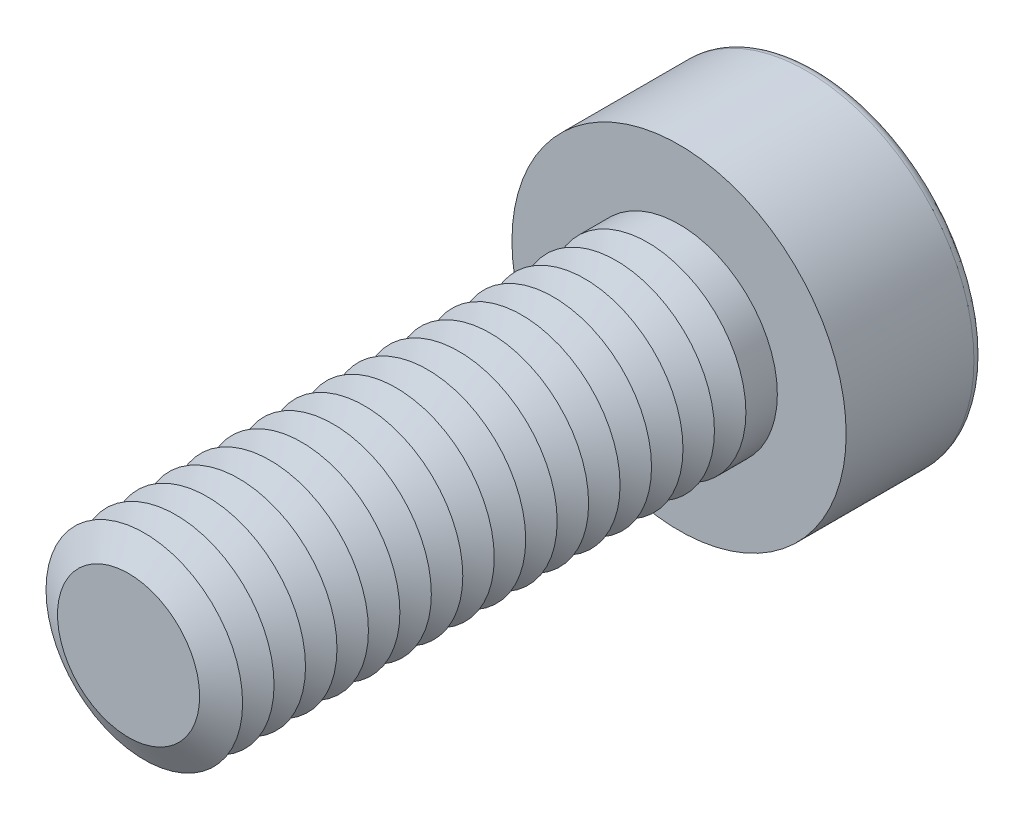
ISO-10303-21;
HEADER;
FILE_DESCRIPTION(('STEP AP214'),'2;1');
FILE_NAME('part.step','',(''),(''),'','','');
FILE_SCHEMA(('AUTOMOTIVE_DESIGN { 1 0 10303 214 1 1 1 1 }'));
ENDSEC;
DATA;
#1=APPLICATION_CONTEXT('core data for automotive mechanical design processes');
#2=APPLICATION_PROTOCOL_DEFINITION('international standard','automotive_design',2000,#1);
#3=PRODUCT_CONTEXT('',#1,'mechanical');
#4=PRODUCT('Part','Part','',(#3));
#5=PRODUCT_RELATED_PRODUCT_CATEGORY('part','',(#4));
#6=PRODUCT_DEFINITION_FORMATION('','',#4);
#7=PRODUCT_DEFINITION_CONTEXT('part definition',#1,'design');
#8=PRODUCT_DEFINITION('design','',#6,#7);
#9=PRODUCT_DEFINITION_SHAPE('','',#8);
#10=(LENGTH_UNIT() NAMED_UNIT(*) SI_UNIT(.MILLI.,.METRE.));
#11=(NAMED_UNIT(*) PLANE_ANGLE_UNIT() SI_UNIT($,.RADIAN.));
#12=(NAMED_UNIT(*) SI_UNIT($,.STERADIAN.) SOLID_ANGLE_UNIT());
#13=UNCERTAINTY_MEASURE_WITH_UNIT(LENGTH_MEASURE(1.E-05),#10,'distance_accuracy_value','');
#14=(GEOMETRIC_REPRESENTATION_CONTEXT(3) GLOBAL_UNCERTAINTY_ASSIGNED_CONTEXT((#13)) GLOBAL_UNIT_ASSIGNED_CONTEXT((#10,
#11,#12)) REPRESENTATION_CONTEXT('',''));
#15=CARTESIAN_POINT('',(0.,0.,0.));
#16=DIRECTION('',(0.,0.,1.));
#17=DIRECTION('',(1.,0.,0.));
#18=AXIS2_PLACEMENT_3D('',#15,#16,#17);
#19=CARTESIAN_POINT('',(0.,0.,11.2));
#20=DIRECTION('',(0.,0.,1.));
#21=DIRECTION('',(1.,0.,0.));
#22=AXIS2_PLACEMENT_3D('',#19,#20,#21);
#23=CONICAL_SURFACE('',#22,2.5,1.0471975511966);
#24=CARTESIAN_POINT('',(0.,0.,10.8));
#25=DIRECTION('',(0.,0.,1.));
#26=DIRECTION('',(1.,0.,0.));
#27=AXIS2_PLACEMENT_3D('',#24,#25,#26);
#28=CIRCLE('',#27,1.80717967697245);
#29=CARTESIAN_POINT('',(1.80717967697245,0.,10.8));
#30=VERTEX_POINT('',#29);
#31=EDGE_CURVE('E312',#30,#30,#28,.T.);
#32=ORIENTED_EDGE('',*,*,#31,.T.);
#33=EDGE_LOOP('',(#32));
#34=FACE_BOUND('',#33,.T.);
#35=CARTESIAN_POINT('',(0.,0.,11.2));
#36=DIRECTION('',(0.,0.,1.));
#37=DIRECTION('',(1.,0.,0.));
#38=AXIS2_PLACEMENT_3D('',#35,#36,#37);
#39=CIRCLE('',#38,2.5);
#40=CARTESIAN_POINT('',(2.5,0.,11.2));
#41=VERTEX_POINT('',#40);
#42=EDGE_CURVE('E315',#41,#41,#39,.T.);
#43=ORIENTED_EDGE('',*,*,#42,.F.);
#44=EDGE_LOOP('',(#43));
#45=FACE_BOUND('',#44,.T.);
#46=ADVANCED_FACE('F39',(#34,#45),#23,.T.);
#47=CARTESIAN_POINT('',(0.,0.,10.8));
#48=DIRECTION('',(0.,0.,-1.));
#49=DIRECTION('',(-1.,0.,0.));
#50=AXIS2_PLACEMENT_3D('',#47,#48,#49);
#51=CONICAL_SURFACE('',#50,1.80717967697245,1.0471975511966);
#52=CARTESIAN_POINT('',(0.,0.,10.4));
#53=DIRECTION('',(0.,0.,1.));
#54=DIRECTION('',(1.,0.,0.));
#55=AXIS2_PLACEMENT_3D('',#52,#53,#54);
#56=CIRCLE('',#55,2.5);
#57=CARTESIAN_POINT('',(2.5,0.,10.4));
#58=VERTEX_POINT('',#57);
#59=EDGE_CURVE('E323',#58,#58,#56,.T.);
#60=ORIENTED_EDGE('',*,*,#59,.T.);
#61=EDGE_LOOP('',(#60));
#62=FACE_BOUND('',#61,.T.);
#63=ORIENTED_EDGE('',*,*,#31,.F.);
#64=EDGE_LOOP('',(#63));
#65=FACE_BOUND('',#64,.T.);
#66=ADVANCED_FACE('F244',(#62,#65),#51,.T.);
#67=CARTESIAN_POINT('',(0.,0.,14.));
#68=DIRECTION('',(0.,0.,1.));
#69=DIRECTION('',(1.,0.,0.));
#70=AXIS2_PLACEMENT_3D('',#67,#68,#69);
#71=PLANE('',#70);
#72=CARTESIAN_POINT('',(0.,0.,14.));
#73=DIRECTION('',(0.,0.,1.));
#74=DIRECTION('',(1.,0.,0.));
#75=AXIS2_PLACEMENT_3D('',#72,#73,#74);
#76=CIRCLE('',#75,1.80717967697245);
#77=CARTESIAN_POINT('',(1.80717967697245,0.,14.));
#78=VERTEX_POINT('',#77);
#79=EDGE_CURVE('E173',#78,#78,#76,.T.);
#80=ORIENTED_EDGE('',*,*,#79,.T.);
#81=EDGE_LOOP('',(#80));
#82=FACE_BOUND('',#81,.T.);
#83=ADVANCED_FACE('F250',(#82),#71,.T.);
#84=CARTESIAN_POINT('',(0.,0.,14.));
#85=DIRECTION('',(0.,0.,-1.));
#86=DIRECTION('',(-1.,0.,0.));
#87=AXIS2_PLACEMENT_3D('',#84,#85,#86);
#88=CONICAL_SURFACE('',#87,1.80717967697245,1.0471975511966);
#89=CARTESIAN_POINT('',(0.,0.,13.6));
#90=DIRECTION('',(0.,0.,1.));
#91=DIRECTION('',(1.,0.,0.));
#92=AXIS2_PLACEMENT_3D('',#89,#90,#91);
#93=CIRCLE('',#92,2.5);
#94=CARTESIAN_POINT('',(2.5,0.,13.6));
#95=VERTEX_POINT('',#94);
#96=EDGE_CURVE('E290',#95,#95,#93,.T.);
#97=ORIENTED_EDGE('',*,*,#96,.T.);
#98=EDGE_LOOP('',(#97));
#99=FACE_BOUND('',#98,.T.);
#100=ORIENTED_EDGE('',*,*,#79,.F.);
#101=EDGE_LOOP('',(#100));
#102=FACE_BOUND('',#101,.T.);
#103=ADVANCED_FACE('F198',(#99,#102),#88,.T.);
#104=CARTESIAN_POINT('',(0.,0.,13.6));
#105=DIRECTION('',(0.,0.,1.));
#106=DIRECTION('',(1.,0.,0.));
#107=AXIS2_PLACEMENT_3D('',#104,#105,#106);
#108=CONICAL_SURFACE('',#107,2.5,1.0471975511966);
#109=CARTESIAN_POINT('',(0.,0.,13.2));
#110=DIRECTION('',(0.,0.,1.));
#111=DIRECTION('',(1.,0.,0.));
#112=AXIS2_PLACEMENT_3D('',#109,#110,#111);
#113=CIRCLE('',#112,1.80717967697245);
#114=CARTESIAN_POINT('',(1.80717967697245,0.,13.2));
#115=VERTEX_POINT('',#114);
#116=EDGE_CURVE('E287',#115,#115,#113,.T.);
#117=ORIENTED_EDGE('',*,*,#116,.T.);
#118=EDGE_LOOP('',(#117));
#119=FACE_BOUND('',#118,.T.);
#120=ORIENTED_EDGE('',*,*,#96,.F.);
#121=EDGE_LOOP('',(#120));
#122=FACE_BOUND('',#121,.T.);
#123=ADVANCED_FACE('F276',(#119,#122),#108,.T.);
#124=CARTESIAN_POINT('',(0.,0.,13.2));
#125=DIRECTION('',(0.,0.,-1.));
#126=DIRECTION('',(-1.,0.,0.));
#127=AXIS2_PLACEMENT_3D('',#124,#125,#126);
#128=CONICAL_SURFACE('',#127,1.80717967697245,1.0471975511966);
#129=CARTESIAN_POINT('',(0.,0.,12.8));
#130=DIRECTION('',(0.,0.,1.));
#131=DIRECTION('',(1.,0.,0.));
#132=AXIS2_PLACEMENT_3D('',#129,#130,#131);
#133=CIRCLE('',#132,2.5);
#134=CARTESIAN_POINT('',(2.5,0.,12.8));
#135=VERTEX_POINT('',#134);
#136=EDGE_CURVE('E298',#135,#135,#133,.T.);
#137=ORIENTED_EDGE('',*,*,#136,.T.);
#138=EDGE_LOOP('',(#137));
#139=FACE_BOUND('',#138,.T.);
#140=ORIENTED_EDGE('',*,*,#116,.F.);
#141=EDGE_LOOP('',(#140));
#142=FACE_BOUND('',#141,.T.);
#143=ADVANCED_FACE('F273',(#139,#142),#128,.T.);
#144=CARTESIAN_POINT('',(0.,0.,12.8));
#145=DIRECTION('',(0.,0.,1.));
#146=DIRECTION('',(1.,0.,0.));
#147=AXIS2_PLACEMENT_3D('',#144,#145,#146);
#148=CONICAL_SURFACE('',#147,2.5,1.0471975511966);
#149=CARTESIAN_POINT('',(0.,0.,12.4));
#150=DIRECTION('',(0.,0.,1.));
#151=DIRECTION('',(1.,0.,0.));
#152=AXIS2_PLACEMENT_3D('',#149,#150,#151);
#153=CIRCLE('',#152,1.80717967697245);
#154=CARTESIAN_POINT('',(1.80717967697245,0.,12.4));
#155=VERTEX_POINT('',#154);
#156=EDGE_CURVE('E292',#155,#155,#153,.T.);
#157=ORIENTED_EDGE('',*,*,#156,.T.);
#158=EDGE_LOOP('',(#157));
#159=FACE_BOUND('',#158,.T.);
#160=ORIENTED_EDGE('',*,*,#136,.F.);
#161=EDGE_LOOP('',(#160));
#162=FACE_BOUND('',#161,.T.);
#163=ADVANCED_FACE('F269',(#159,#162),#148,.T.);
#164=CARTESIAN_POINT('',(0.,0.,12.4));
#165=DIRECTION('',(0.,0.,-1.));
#166=DIRECTION('',(-1.,0.,0.));
#167=AXIS2_PLACEMENT_3D('',#164,#165,#166);
#168=CONICAL_SURFACE('',#167,1.80717967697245,1.0471975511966);
#169=CARTESIAN_POINT('',(0.,0.,12.));
#170=DIRECTION('',(0.,0.,1.));
#171=DIRECTION('',(1.,0.,0.));
#172=AXIS2_PLACEMENT_3D('',#169,#170,#171);
#173=CIRCLE('',#172,2.5);
#174=CARTESIAN_POINT('',(2.5,0.,12.));
#175=VERTEX_POINT('',#174);
#176=EDGE_CURVE('E308',#175,#175,#173,.T.);
#177=ORIENTED_EDGE('',*,*,#176,.T.);
#178=EDGE_LOOP('',(#177));
#179=FACE_BOUND('',#178,.T.);
#180=ORIENTED_EDGE('',*,*,#156,.F.);
#181=EDGE_LOOP('',(#180));
#182=FACE_BOUND('',#181,.T.);
#183=ADVANCED_FACE('F265',(#179,#182),#168,.T.);
#184=CARTESIAN_POINT('',(0.,0.,12.));
#185=DIRECTION('',(0.,0.,1.));
#186=DIRECTION('',(1.,0.,0.));
#187=AXIS2_PLACEMENT_3D('',#184,#185,#186);
#188=CONICAL_SURFACE('',#187,2.5,1.0471975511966);
#189=CARTESIAN_POINT('',(0.,0.,11.6));
#190=DIRECTION('',(0.,0.,1.));
#191=DIRECTION('',(1.,0.,0.));
#192=AXIS2_PLACEMENT_3D('',#189,#190,#191);
#193=CIRCLE('',#192,1.80717967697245);
#194=CARTESIAN_POINT('',(1.80717967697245,0.,11.6));
#195=VERTEX_POINT('',#194);
#196=EDGE_CURVE('E304',#195,#195,#193,.T.);
#197=ORIENTED_EDGE('',*,*,#196,.T.);
#198=EDGE_LOOP('',(#197));
#199=FACE_BOUND('',#198,.T.);
#200=ORIENTED_EDGE('',*,*,#176,.F.);
#201=EDGE_LOOP('',(#200));
#202=FACE_BOUND('',#201,.T.);
#203=ADVANCED_FACE('F261',(#199,#202),#188,.T.);
#204=CARTESIAN_POINT('',(0.,0.,11.6));
#205=DIRECTION('',(0.,0.,-1.));
#206=DIRECTION('',(-1.,0.,0.));
#207=AXIS2_PLACEMENT_3D('',#204,#205,#206);
#208=CONICAL_SURFACE('',#207,1.80717967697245,1.0471975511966);
#209=ORIENTED_EDGE('',*,*,#42,.T.);
#210=EDGE_LOOP('',(#209));
#211=FACE_BOUND('',#210,.T.);
#212=ORIENTED_EDGE('',*,*,#196,.F.);
#213=EDGE_LOOP('',(#212));
#214=FACE_BOUND('',#213,.T.);
#215=ADVANCED_FACE('F257',(#211,#214),#208,.T.);
#216=CARTESIAN_POINT('',(0.,0.,10.4));
#217=DIRECTION('',(0.,0.,1.));
#218=DIRECTION('',(1.,0.,0.));
#219=AXIS2_PLACEMENT_3D('',#216,#217,#218);
#220=CONICAL_SURFACE('',#219,2.5,1.0471975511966);
#221=CARTESIAN_POINT('',(0.,0.,10.));
#222=DIRECTION('',(0.,0.,1.));
#223=DIRECTION('',(1.,0.,0.));
#224=AXIS2_PLACEMENT_3D('',#221,#222,#223);
#225=CIRCLE('',#224,1.80717967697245);
#226=CARTESIAN_POINT('',(1.80717967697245,0.,10.));
#227=VERTEX_POINT('',#226);
#228=EDGE_CURVE('E319',#227,#227,#225,.T.);
#229=ORIENTED_EDGE('',*,*,#228,.T.);
#230=EDGE_LOOP('',(#229));
#231=FACE_BOUND('',#230,.T.);
#232=ORIENTED_EDGE('',*,*,#59,.F.);
#233=EDGE_LOOP('',(#232));
#234=FACE_BOUND('',#233,.T.);
#235=ADVANCED_FACE('F260',(#231,#234),#220,.T.);
#236=CARTESIAN_POINT('',(0.,0.,10.));
#237=DIRECTION('',(0.,0.,-1.));
#238=DIRECTION('',(-1.,0.,0.));
#239=AXIS2_PLACEMENT_3D('',#236,#237,#238);
#240=CONICAL_SURFACE('',#239,1.80717967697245,1.0471975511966);
#241=CARTESIAN_POINT('',(0.,0.,9.6));
#242=DIRECTION('',(0.,0.,1.));
#243=DIRECTION('',(1.,0.,0.));
#244=AXIS2_PLACEMENT_3D('',#241,#242,#243);
#245=CIRCLE('',#244,2.5);
#246=CARTESIAN_POINT('',(2.5,0.,9.6));
#247=VERTEX_POINT('',#246);
#248=EDGE_CURVE('E330',#247,#247,#245,.T.);
#249=ORIENTED_EDGE('',*,*,#248,.T.);
#250=EDGE_LOOP('',(#249));
#251=FACE_BOUND('',#250,.T.);
#252=ORIENTED_EDGE('',*,*,#228,.F.);
#253=EDGE_LOOP('',(#252));
#254=FACE_BOUND('',#253,.T.);
#255=ADVANCED_FACE('F509',(#251,#254),#240,.T.);
#256=CARTESIAN_POINT('',(0.,0.,9.6));
#257=DIRECTION('',(0.,0.,1.));
#258=DIRECTION('',(1.,0.,0.));
#259=AXIS2_PLACEMENT_3D('',#256,#257,#258);
#260=CONICAL_SURFACE('',#259,2.5,1.0471975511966);
#261=CARTESIAN_POINT('',(0.,0.,9.2));
#262=DIRECTION('',(0.,0.,1.));
#263=DIRECTION('',(1.,0.,0.));
#264=AXIS2_PLACEMENT_3D('',#261,#262,#263);
#265=CIRCLE('',#264,1.80717967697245);
#266=CARTESIAN_POINT('',(1.80717967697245,0.,9.2));
#267=VERTEX_POINT('',#266);
#268=EDGE_CURVE('E326',#267,#267,#265,.T.);
#269=ORIENTED_EDGE('',*,*,#268,.T.);
#270=EDGE_LOOP('',(#269));
#271=FACE_BOUND('',#270,.T.);
#272=ORIENTED_EDGE('',*,*,#248,.F.);
#273=EDGE_LOOP('',(#272));
#274=FACE_BOUND('',#273,.T.);
#275=ADVANCED_FACE('F505',(#271,#274),#260,.T.);
#276=CARTESIAN_POINT('',(0.,0.,9.2));
#277=DIRECTION('',(0.,0.,-1.));
#278=DIRECTION('',(-1.,0.,0.));
#279=AXIS2_PLACEMENT_3D('',#276,#277,#278);
#280=CONICAL_SURFACE('',#279,1.80717967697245,1.0471975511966);
#281=CARTESIAN_POINT('',(0.,0.,8.8));
#282=DIRECTION('',(0.,0.,1.));
#283=DIRECTION('',(1.,0.,0.));
#284=AXIS2_PLACEMENT_3D('',#281,#282,#283);
#285=CIRCLE('',#284,2.5);
#286=CARTESIAN_POINT('',(2.5,0.,8.8));
#287=VERTEX_POINT('',#286);
#288=EDGE_CURVE('E338',#287,#287,#285,.T.);
#289=ORIENTED_EDGE('',*,*,#288,.T.);
#290=EDGE_LOOP('',(#289));
#291=FACE_BOUND('',#290,.T.);
#292=ORIENTED_EDGE('',*,*,#268,.F.);
#293=EDGE_LOOP('',(#292));
#294=FACE_BOUND('',#293,.T.);
#295=ADVANCED_FACE('F501',(#291,#294),#280,.T.);
#296=CARTESIAN_POINT('',(0.,0.,8.8));
#297=DIRECTION('',(0.,0.,1.));
#298=DIRECTION('',(1.,0.,0.));
#299=AXIS2_PLACEMENT_3D('',#296,#297,#298);
#300=CONICAL_SURFACE('',#299,2.5,1.0471975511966);
#301=CARTESIAN_POINT('',(0.,0.,8.4));
#302=DIRECTION('',(0.,0.,1.));
#303=DIRECTION('',(1.,0.,0.));
#304=AXIS2_PLACEMENT_3D('',#301,#302,#303);
#305=CIRCLE('',#304,1.80717967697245);
#306=CARTESIAN_POINT('',(1.80717967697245,0.,8.4));
#307=VERTEX_POINT('',#306);
#308=EDGE_CURVE('E334',#307,#307,#305,.T.);
#309=ORIENTED_EDGE('',*,*,#308,.T.);
#310=EDGE_LOOP('',(#309));
#311=FACE_BOUND('',#310,.T.);
#312=ORIENTED_EDGE('',*,*,#288,.F.);
#313=EDGE_LOOP('',(#312));
#314=FACE_BOUND('',#313,.T.);
#315=ADVANCED_FACE('F497',(#311,#314),#300,.T.);
#316=CARTESIAN_POINT('',(0.,0.,8.4));
#317=DIRECTION('',(0.,0.,-1.));
#318=DIRECTION('',(-1.,0.,0.));
#319=AXIS2_PLACEMENT_3D('',#316,#317,#318);
#320=CONICAL_SURFACE('',#319,1.80717967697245,1.0471975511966);
#321=CARTESIAN_POINT('',(0.,0.,8.));
#322=DIRECTION('',(0.,0.,1.));
#323=DIRECTION('',(1.,0.,0.));
#324=AXIS2_PLACEMENT_3D('',#321,#322,#323);
#325=CIRCLE('',#324,2.5);
#326=CARTESIAN_POINT('',(2.5,0.,8.));
#327=VERTEX_POINT('',#326);
#328=EDGE_CURVE('E345',#327,#327,#325,.T.);
#329=ORIENTED_EDGE('',*,*,#328,.T.);
#330=EDGE_LOOP('',(#329));
#331=FACE_BOUND('',#330,.T.);
#332=ORIENTED_EDGE('',*,*,#308,.F.);
#333=EDGE_LOOP('',(#332));
#334=FACE_BOUND('',#333,.T.);
#335=ADVANCED_FACE('F493',(#331,#334),#320,.T.);
#336=CARTESIAN_POINT('',(0.,0.,8.));
#337=DIRECTION('',(0.,0.,1.));
#338=DIRECTION('',(1.,0.,0.));
#339=AXIS2_PLACEMENT_3D('',#336,#337,#338);
#340=CONICAL_SURFACE('',#339,2.5,1.0471975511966);
#341=CARTESIAN_POINT('',(0.,0.,7.6));
#342=DIRECTION('',(0.,0.,1.));
#343=DIRECTION('',(1.,0.,0.));
#344=AXIS2_PLACEMENT_3D('',#341,#342,#343);
#345=CIRCLE('',#344,1.80717967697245);
#346=CARTESIAN_POINT('',(1.80717967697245,0.,7.6));
#347=VERTEX_POINT('',#346);
#348=EDGE_CURVE('E341',#347,#347,#345,.T.);
#349=ORIENTED_EDGE('',*,*,#348,.T.);
#350=EDGE_LOOP('',(#349));
#351=FACE_BOUND('',#350,.T.);
#352=ORIENTED_EDGE('',*,*,#328,.F.);
#353=EDGE_LOOP('',(#352));
#354=FACE_BOUND('',#353,.T.);
#355=ADVANCED_FACE('F489',(#351,#354),#340,.T.);
#356=CARTESIAN_POINT('',(0.,0.,7.6));
#357=DIRECTION('',(0.,0.,-1.));
#358=DIRECTION('',(-1.,0.,0.));
#359=AXIS2_PLACEMENT_3D('',#356,#357,#358);
#360=CONICAL_SURFACE('',#359,1.80717967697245,1.0471975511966);
#361=CARTESIAN_POINT('',(0.,0.,7.2));
#362=DIRECTION('',(0.,0.,1.));
#363=DIRECTION('',(1.,0.,0.));
#364=AXIS2_PLACEMENT_3D('',#361,#362,#363);
#365=CIRCLE('',#364,2.5);
#366=CARTESIAN_POINT('',(2.5,0.,7.2));
#367=VERTEX_POINT('',#366);
#368=EDGE_CURVE('E353',#367,#367,#365,.T.);
#369=ORIENTED_EDGE('',*,*,#368,.T.);
#370=EDGE_LOOP('',(#369));
#371=FACE_BOUND('',#370,.T.);
#372=ORIENTED_EDGE('',*,*,#348,.F.);
#373=EDGE_LOOP('',(#372));
#374=FACE_BOUND('',#373,.T.);
#375=ADVANCED_FACE('F485',(#371,#374),#360,.T.);
#376=CARTESIAN_POINT('',(0.,0.,7.2));
#377=DIRECTION('',(0.,0.,1.));
#378=DIRECTION('',(1.,0.,0.));
#379=AXIS2_PLACEMENT_3D('',#376,#377,#378);
#380=CONICAL_SURFACE('',#379,2.5,1.0471975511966);
#381=CARTESIAN_POINT('',(0.,0.,6.8));
#382=DIRECTION('',(0.,0.,1.));
#383=DIRECTION('',(1.,0.,0.));
#384=AXIS2_PLACEMENT_3D('',#381,#382,#383);
#385=CIRCLE('',#384,1.80717967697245);
#386=CARTESIAN_POINT('',(1.80717967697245,0.,6.8));
#387=VERTEX_POINT('',#386);
#388=EDGE_CURVE('E349',#387,#387,#385,.T.);
#389=ORIENTED_EDGE('',*,*,#388,.T.);
#390=EDGE_LOOP('',(#389));
#391=FACE_BOUND('',#390,.T.);
#392=ORIENTED_EDGE('',*,*,#368,.F.);
#393=EDGE_LOOP('',(#392));
#394=FACE_BOUND('',#393,.T.);
#395=ADVANCED_FACE('F481',(#391,#394),#380,.T.);
#396=CARTESIAN_POINT('',(0.,0.,6.8));
#397=DIRECTION('',(0.,0.,-1.));
#398=DIRECTION('',(-1.,0.,0.));
#399=AXIS2_PLACEMENT_3D('',#396,#397,#398);
#400=CONICAL_SURFACE('',#399,1.80717967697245,1.0471975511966);
#401=CARTESIAN_POINT('',(0.,0.,6.4));
#402=DIRECTION('',(0.,0.,1.));
#403=DIRECTION('',(1.,0.,0.));
#404=AXIS2_PLACEMENT_3D('',#401,#402,#403);
#405=CIRCLE('',#404,2.5);
#406=CARTESIAN_POINT('',(2.5,0.,6.4));
#407=VERTEX_POINT('',#406);
#408=EDGE_CURVE('E361',#407,#407,#405,.T.);
#409=ORIENTED_EDGE('',*,*,#408,.T.);
#410=EDGE_LOOP('',(#409));
#411=FACE_BOUND('',#410,.T.);
#412=ORIENTED_EDGE('',*,*,#388,.F.);
#413=EDGE_LOOP('',(#412));
#414=FACE_BOUND('',#413,.T.);
#415=ADVANCED_FACE('F477',(#411,#414),#400,.T.);
#416=CARTESIAN_POINT('',(0.,0.,6.4));
#417=DIRECTION('',(0.,0.,1.));
#418=DIRECTION('',(1.,0.,0.));
#419=AXIS2_PLACEMENT_3D('',#416,#417,#418);
#420=CONICAL_SURFACE('',#419,2.5,1.0471975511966);
#421=CARTESIAN_POINT('',(0.,0.,6.));
#422=DIRECTION('',(0.,0.,1.));
#423=DIRECTION('',(1.,0.,0.));
#424=AXIS2_PLACEMENT_3D('',#421,#422,#423);
#425=CIRCLE('',#424,1.80717967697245);
#426=CARTESIAN_POINT('',(1.80717967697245,0.,6.));
#427=VERTEX_POINT('',#426);
#428=EDGE_CURVE('E357',#427,#427,#425,.T.);
#429=ORIENTED_EDGE('',*,*,#428,.T.);
#430=EDGE_LOOP('',(#429));
#431=FACE_BOUND('',#430,.T.);
#432=ORIENTED_EDGE('',*,*,#408,.F.);
#433=EDGE_LOOP('',(#432));
#434=FACE_BOUND('',#433,.T.);
#435=ADVANCED_FACE('F473',(#431,#434),#420,.T.);
#436=CARTESIAN_POINT('',(0.,0.,6.));
#437=DIRECTION('',(0.,0.,-1.));
#438=DIRECTION('',(-1.,0.,0.));
#439=AXIS2_PLACEMENT_3D('',#436,#437,#438);
#440=CONICAL_SURFACE('',#439,1.80717967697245,1.0471975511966);
#441=CARTESIAN_POINT('',(0.,0.,5.6));
#442=DIRECTION('',(0.,0.,1.));
#443=DIRECTION('',(1.,0.,0.));
#444=AXIS2_PLACEMENT_3D('',#441,#442,#443);
#445=CIRCLE('',#444,2.5);
#446=CARTESIAN_POINT('',(2.5,0.,5.6));
#447=VERTEX_POINT('',#446);
#448=EDGE_CURVE('E369',#447,#447,#445,.T.);
#449=ORIENTED_EDGE('',*,*,#448,.T.);
#450=EDGE_LOOP('',(#449));
#451=FACE_BOUND('',#450,.T.);
#452=ORIENTED_EDGE('',*,*,#428,.F.);
#453=EDGE_LOOP('',(#452));
#454=FACE_BOUND('',#453,.T.);
#455=ADVANCED_FACE('F469',(#451,#454),#440,.T.);
#456=CARTESIAN_POINT('',(0.,0.,5.6));
#457=DIRECTION('',(0.,0.,1.));
#458=DIRECTION('',(1.,0.,0.));
#459=AXIS2_PLACEMENT_3D('',#456,#457,#458);
#460=CONICAL_SURFACE('',#459,2.5,1.0471975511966);
#461=CARTESIAN_POINT('',(0.,0.,5.2));
#462=DIRECTION('',(0.,0.,1.));
#463=DIRECTION('',(1.,0.,0.));
#464=AXIS2_PLACEMENT_3D('',#461,#462,#463);
#465=CIRCLE('',#464,1.80717967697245);
#466=CARTESIAN_POINT('',(1.80717967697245,0.,5.2));
#467=VERTEX_POINT('',#466);
#468=EDGE_CURVE('E365',#467,#467,#465,.T.);
#469=ORIENTED_EDGE('',*,*,#468,.T.);
#470=EDGE_LOOP('',(#469));
#471=FACE_BOUND('',#470,.T.);
#472=ORIENTED_EDGE('',*,*,#448,.F.);
#473=EDGE_LOOP('',(#472));
#474=FACE_BOUND('',#473,.T.);
#475=ADVANCED_FACE('F465',(#471,#474),#460,.T.);
#476=CARTESIAN_POINT('',(0.,0.,5.2));
#477=DIRECTION('',(0.,0.,-1.));
#478=DIRECTION('',(-1.,0.,0.));
#479=AXIS2_PLACEMENT_3D('',#476,#477,#478);
#480=CONICAL_SURFACE('',#479,1.80717967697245,1.0471975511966);
#481=CARTESIAN_POINT('',(0.,0.,4.8));
#482=DIRECTION('',(0.,0.,1.));
#483=DIRECTION('',(1.,0.,0.));
#484=AXIS2_PLACEMENT_3D('',#481,#482,#483);
#485=CIRCLE('',#484,2.5);
#486=CARTESIAN_POINT('',(2.5,0.,4.8));
#487=VERTEX_POINT('',#486);
#488=EDGE_CURVE('E377',#487,#487,#485,.T.);
#489=ORIENTED_EDGE('',*,*,#488,.T.);
#490=EDGE_LOOP('',(#489));
#491=FACE_BOUND('',#490,.T.);
#492=ORIENTED_EDGE('',*,*,#468,.F.);
#493=EDGE_LOOP('',(#492));
#494=FACE_BOUND('',#493,.T.);
#495=ADVANCED_FACE('F461',(#491,#494),#480,.T.);
#496=CARTESIAN_POINT('',(0.,0.,4.8));
#497=DIRECTION('',(0.,0.,1.));
#498=DIRECTION('',(1.,0.,0.));
#499=AXIS2_PLACEMENT_3D('',#496,#497,#498);
#500=CONICAL_SURFACE('',#499,2.5,1.0471975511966);
#501=CARTESIAN_POINT('',(0.,0.,4.4));
#502=DIRECTION('',(0.,0.,1.));
#503=DIRECTION('',(1.,0.,0.));
#504=AXIS2_PLACEMENT_3D('',#501,#502,#503);
#505=CIRCLE('',#504,1.80717967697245);
#506=CARTESIAN_POINT('',(1.80717967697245,0.,4.4));
#507=VERTEX_POINT('',#506);
#508=EDGE_CURVE('E373',#507,#507,#505,.T.);
#509=ORIENTED_EDGE('',*,*,#508,.T.);
#510=EDGE_LOOP('',(#509));
#511=FACE_BOUND('',#510,.T.);
#512=ORIENTED_EDGE('',*,*,#488,.F.);
#513=EDGE_LOOP('',(#512));
#514=FACE_BOUND('',#513,.T.);
#515=ADVANCED_FACE('F457',(#511,#514),#500,.T.);
#516=CARTESIAN_POINT('',(0.,0.,4.4));
#517=DIRECTION('',(0.,0.,-1.));
#518=DIRECTION('',(-1.,0.,0.));
#519=AXIS2_PLACEMENT_3D('',#516,#517,#518);
#520=CONICAL_SURFACE('',#519,1.80717967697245,1.0471975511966);
#521=CARTESIAN_POINT('',(0.,0.,4.));
#522=DIRECTION('',(0.,0.,1.));
#523=DIRECTION('',(1.,0.,0.));
#524=AXIS2_PLACEMENT_3D('',#521,#522,#523);
#525=CIRCLE('',#524,2.5);
#526=CARTESIAN_POINT('',(2.5,0.,4.));
#527=VERTEX_POINT('',#526);
#528=EDGE_CURVE('E385',#527,#527,#525,.T.);
#529=ORIENTED_EDGE('',*,*,#528,.T.);
#530=EDGE_LOOP('',(#529));
#531=FACE_BOUND('',#530,.T.);
#532=ORIENTED_EDGE('',*,*,#508,.F.);
#533=EDGE_LOOP('',(#532));
#534=FACE_BOUND('',#533,.T.);
#535=ADVANCED_FACE('F453',(#531,#534),#520,.T.);
#536=CARTESIAN_POINT('',(0.,0.,4.));
#537=DIRECTION('',(0.,0.,1.));
#538=DIRECTION('',(1.,0.,0.));
#539=AXIS2_PLACEMENT_3D('',#536,#537,#538);
#540=CONICAL_SURFACE('',#539,2.5,1.0471975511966);
#541=CARTESIAN_POINT('',(0.,0.,3.6));
#542=DIRECTION('',(0.,0.,1.));
#543=DIRECTION('',(1.,0.,0.));
#544=AXIS2_PLACEMENT_3D('',#541,#542,#543);
#545=CIRCLE('',#544,1.80717967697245);
#546=CARTESIAN_POINT('',(1.80717967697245,0.,3.6));
#547=VERTEX_POINT('',#546);
#548=EDGE_CURVE('E381',#547,#547,#545,.T.);
#549=ORIENTED_EDGE('',*,*,#548,.T.);
#550=EDGE_LOOP('',(#549));
#551=FACE_BOUND('',#550,.T.);
#552=ORIENTED_EDGE('',*,*,#528,.F.);
#553=EDGE_LOOP('',(#552));
#554=FACE_BOUND('',#553,.T.);
#555=ADVANCED_FACE('F449',(#551,#554),#540,.T.);
#556=CARTESIAN_POINT('',(0.,0.,3.6));
#557=DIRECTION('',(0.,0.,-1.));
#558=DIRECTION('',(-1.,0.,0.));
#559=AXIS2_PLACEMENT_3D('',#556,#557,#558);
#560=CONICAL_SURFACE('',#559,1.80717967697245,1.0471975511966);
#561=CARTESIAN_POINT('',(0.,0.,3.2));
#562=DIRECTION('',(0.,0.,1.));
#563=DIRECTION('',(1.,0.,0.));
#564=AXIS2_PLACEMENT_3D('',#561,#562,#563);
#565=CIRCLE('',#564,2.5);
#566=CARTESIAN_POINT('',(2.5,0.,3.2));
#567=VERTEX_POINT('',#566);
#568=EDGE_CURVE('E393',#567,#567,#565,.T.);
#569=ORIENTED_EDGE('',*,*,#568,.T.);
#570=EDGE_LOOP('',(#569));
#571=FACE_BOUND('',#570,.T.);
#572=ORIENTED_EDGE('',*,*,#548,.F.);
#573=EDGE_LOOP('',(#572));
#574=FACE_BOUND('',#573,.T.);
#575=ADVANCED_FACE('F445',(#571,#574),#560,.T.);
#576=CARTESIAN_POINT('',(0.,0.,3.2));
#577=DIRECTION('',(0.,0.,1.));
#578=DIRECTION('',(1.,0.,0.));
#579=AXIS2_PLACEMENT_3D('',#576,#577,#578);
#580=CONICAL_SURFACE('',#579,2.5,1.0471975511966);
#581=CARTESIAN_POINT('',(0.,0.,2.8));
#582=DIRECTION('',(0.,0.,1.));
#583=DIRECTION('',(1.,0.,0.));
#584=AXIS2_PLACEMENT_3D('',#581,#582,#583);
#585=CIRCLE('',#584,1.80717967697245);
#586=CARTESIAN_POINT('',(1.80717967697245,0.,2.8));
#587=VERTEX_POINT('',#586);
#588=EDGE_CURVE('E389',#587,#587,#585,.T.);
#589=ORIENTED_EDGE('',*,*,#588,.T.);
#590=EDGE_LOOP('',(#589));
#591=FACE_BOUND('',#590,.T.);
#592=ORIENTED_EDGE('',*,*,#568,.F.);
#593=EDGE_LOOP('',(#592));
#594=FACE_BOUND('',#593,.T.);
#595=ADVANCED_FACE('F441',(#591,#594),#580,.T.);
#596=CARTESIAN_POINT('',(0.,0.,2.8));
#597=DIRECTION('',(0.,0.,-1.));
#598=DIRECTION('',(-1.,0.,0.));
#599=AXIS2_PLACEMENT_3D('',#596,#597,#598);
#600=CONICAL_SURFACE('',#599,1.80717967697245,1.0471975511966);
#601=CARTESIAN_POINT('',(0.,0.,2.4));
#602=DIRECTION('',(0.,0.,1.));
#603=DIRECTION('',(1.,0.,0.));
#604=AXIS2_PLACEMENT_3D('',#601,#602,#603);
#605=CIRCLE('',#604,2.5);
#606=CARTESIAN_POINT('',(2.5,0.,2.4));
#607=VERTEX_POINT('',#606);
#608=EDGE_CURVE('E401',#607,#607,#605,.T.);
#609=ORIENTED_EDGE('',*,*,#608,.T.);
#610=EDGE_LOOP('',(#609));
#611=FACE_BOUND('',#610,.T.);
#612=ORIENTED_EDGE('',*,*,#588,.F.);
#613=EDGE_LOOP('',(#612));
#614=FACE_BOUND('',#613,.T.);
#615=ADVANCED_FACE('F437',(#611,#614),#600,.T.);
#616=CARTESIAN_POINT('',(0.,0.,2.4));
#617=DIRECTION('',(0.,0.,1.));
#618=DIRECTION('',(1.,0.,0.));
#619=AXIS2_PLACEMENT_3D('',#616,#617,#618);
#620=CONICAL_SURFACE('',#619,2.5,1.0471975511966);
#621=CARTESIAN_POINT('',(0.,0.,2.));
#622=DIRECTION('',(0.,0.,1.));
#623=DIRECTION('',(1.,0.,0.));
#624=AXIS2_PLACEMENT_3D('',#621,#622,#623);
#625=CIRCLE('',#624,1.80717967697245);
#626=CARTESIAN_POINT('',(1.80717967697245,0.,2.));
#627=VERTEX_POINT('',#626);
#628=EDGE_CURVE('E397',#627,#627,#625,.T.);
#629=ORIENTED_EDGE('',*,*,#628,.T.);
#630=EDGE_LOOP('',(#629));
#631=FACE_BOUND('',#630,.T.);
#632=ORIENTED_EDGE('',*,*,#608,.F.);
#633=EDGE_LOOP('',(#632));
#634=FACE_BOUND('',#633,.T.);
#635=ADVANCED_FACE('F432',(#631,#634),#620,.T.);
#636=CARTESIAN_POINT('',(0.,0.,2.));
#637=DIRECTION('',(0.,0.,-1.));
#638=DIRECTION('',(-1.,0.,0.));
#639=AXIS2_PLACEMENT_3D('',#636,#637,#638);
#640=CONICAL_SURFACE('',#639,1.80717967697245,1.0471975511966);
#641=CARTESIAN_POINT('',(0.,0.,1.6));
#642=DIRECTION('',(0.,0.,1.));
#643=DIRECTION('',(1.,0.,0.));
#644=AXIS2_PLACEMENT_3D('',#641,#642,#643);
#645=CIRCLE('',#644,2.5);
#646=CARTESIAN_POINT('',(2.5,0.,1.6));
#647=VERTEX_POINT('',#646);
#648=EDGE_CURVE('E413',#647,#647,#645,.T.);
#649=ORIENTED_EDGE('',*,*,#648,.T.);
#650=EDGE_LOOP('',(#649));
#651=FACE_BOUND('',#650,.T.);
#652=ORIENTED_EDGE('',*,*,#628,.F.);
#653=EDGE_LOOP('',(#652));
#654=FACE_BOUND('',#653,.T.);
#655=ADVANCED_FACE('F418',(#651,#654),#640,.T.);
#656=CARTESIAN_POINT('',(0.,0.,1.6));
#657=DIRECTION('',(0.,0.,1.));
#658=DIRECTION('',(1.,0.,0.));
#659=AXIS2_PLACEMENT_3D('',#656,#657,#658);
#660=CONICAL_SURFACE('',#659,2.5,1.0471975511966);
#661=CARTESIAN_POINT('',(0.,0.,1.2));
#662=DIRECTION('',(0.,0.,1.));
#663=DIRECTION('',(1.,0.,0.));
#664=AXIS2_PLACEMENT_3D('',#661,#662,#663);
#665=CIRCLE('',#664,1.80717967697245);
#666=CARTESIAN_POINT('',(1.80717967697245,0.,1.2));
#667=VERTEX_POINT('',#666);
#668=EDGE_CURVE('E405',#667,#667,#665,.T.);
#669=ORIENTED_EDGE('',*,*,#668,.T.);
#670=EDGE_LOOP('',(#669));
#671=FACE_BOUND('',#670,.T.);
#672=ORIENTED_EDGE('',*,*,#648,.F.);
#673=EDGE_LOOP('',(#672));
#674=FACE_BOUND('',#673,.T.);
#675=ADVANCED_FACE('F421',(#671,#674),#660,.T.);
#676=CARTESIAN_POINT('',(0.,0.,1.2));
#677=DIRECTION('',(0.,0.,-1.));
#678=DIRECTION('',(-1.,0.,0.));
#679=AXIS2_PLACEMENT_3D('',#676,#677,#678);
#680=CONICAL_SURFACE('',#679,1.80717967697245,1.0471975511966);
#681=CARTESIAN_POINT('',(0.,0.,0.8));
#682=DIRECTION('',(0.,0.,1.));
#683=DIRECTION('',(1.,0.,0.));
#684=AXIS2_PLACEMENT_3D('',#681,#682,#683);
#685=CIRCLE('',#684,2.5);
#686=CARTESIAN_POINT('',(2.5,0.,0.8));
#687=VERTEX_POINT('',#686);
#688=EDGE_CURVE('E409',#687,#687,#685,.T.);
#689=ORIENTED_EDGE('',*,*,#688,.T.);
#690=EDGE_LOOP('',(#689));
#691=FACE_BOUND('',#690,.T.);
#692=ORIENTED_EDGE('',*,*,#668,.F.);
#693=EDGE_LOOP('',(#692));
#694=FACE_BOUND('',#693,.T.);
#695=ADVANCED_FACE('F423',(#691,#694),#680,.T.);
#696=CARTESIAN_POINT('',(0.,0.,-1.25));
#697=DIRECTION('',(0.,0.,-1.));
#698=DIRECTION('',(-1.,0.,0.));
#699=AXIS2_PLACEMENT_3D('',#696,#697,#698);
#700=CONICAL_SURFACE('',#699,1.5,1.0471975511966);
#701=CARTESIAN_POINT('',(0.,0.,-0.383974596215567));
#702=VERTEX_POINT('',#701);
#703=VERTEX_LOOP('',#702);
#704=FACE_BOUND('',#703,.T.);
#705=CARTESIAN_POINT('',(0.,0.,-1.25));
#706=DIRECTION('',(0.,0.,-1.));
#707=DIRECTION('',(-1.,0.,0.));
#708=AXIS2_PLACEMENT_3D('',#705,#706,#707);
#709=CIRCLE('',#708,1.5);
#710=CARTESIAN_POINT('',(-1.29903810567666,0.749999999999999,-1.25));
#711=VERTEX_POINT('',#710);
#712=CARTESIAN_POINT('',(0.,1.5,-1.25));
#713=VERTEX_POINT('',#712);
#714=EDGE_CURVE('E149',#711,#713,#709,.T.);
#715=ORIENTED_EDGE('',*,*,#714,.T.);
#716=CARTESIAN_POINT('',(0.,0.,-1.25));
#717=DIRECTION('',(0.,0.,-1.));
#718=DIRECTION('',(-1.,0.,0.));
#719=AXIS2_PLACEMENT_3D('',#716,#717,#718);
#720=CIRCLE('',#719,1.5);
#721=CARTESIAN_POINT('',(1.29903810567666,0.75,-1.25));
#722=VERTEX_POINT('',#721);
#723=EDGE_CURVE('E54',#713,#722,#720,.T.);
#724=ORIENTED_EDGE('',*,*,#723,.T.);
#725=CARTESIAN_POINT('',(1.29903810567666,-0.75,-1.25));
#726=VERTEX_POINT('',#725);
#727=EDGE_CURVE('E1026',#722,#726,#720,.T.);
#728=ORIENTED_EDGE('',*,*,#727,.T.);
#729=CARTESIAN_POINT('',(0.,-1.5,-1.25));
#730=VERTEX_POINT('',#729);
#731=EDGE_CURVE('E1025',#726,#730,#720,.T.);
#732=ORIENTED_EDGE('',*,*,#731,.T.);
#733=CARTESIAN_POINT('',(-1.29903810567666,-0.749999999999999,-1.25));
#734=VERTEX_POINT('',#733);
#735=EDGE_CURVE('E1018',#730,#734,#720,.T.);
#736=ORIENTED_EDGE('',*,*,#735,.T.);
#737=EDGE_CURVE('E1016',#734,#711,#720,.T.);
#738=ORIENTED_EDGE('',*,*,#737,.T.);
#739=EDGE_LOOP('',(#715,#724,#728,#732,#736,#738));
#740=FACE_BOUND('',#739,.T.);
#741=ADVANCED_FACE('F200',(#704,#740),#700,.F.);
#742=CARTESIAN_POINT('',(0.,0.,-1.25));
#743=DIRECTION('',(0.,0.,-1.));
#744=DIRECTION('',(-1.,0.,0.));
#745=AXIS2_PLACEMENT_3D('',#742,#743,#744);
#746=PLANE('',#745);
#747=ORIENTED_EDGE('',*,*,#723,.F.);
#748=DIRECTION('',(1.,0.,0.));
#749=VECTOR('',#748,1.);
#750=CARTESIAN_POINT('',(-0.866025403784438,1.5,-1.25));
#751=LINE('',#750,#749);
#752=CARTESIAN_POINT('',(0.86602540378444,1.5,-1.25));
#753=VERTEX_POINT('',#752);
#754=EDGE_CURVE('E1065',#713,#753,#751,.T.);
#755=ORIENTED_EDGE('',*,*,#754,.T.);
#756=DIRECTION('',(0.5,-0.866025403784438,0.));
#757=VECTOR('',#756,1.);
#758=CARTESIAN_POINT('',(0.86602540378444,1.5,-1.25));
#759=LINE('',#758,#757);
#760=EDGE_CURVE('E155',#753,#722,#759,.T.);
#761=ORIENTED_EDGE('',*,*,#760,.T.);
#762=EDGE_LOOP('',(#747,#755,#761));
#763=FACE_BOUND('',#762,.T.);
#764=ADVANCED_FACE('F604',(#763),#746,.T.);
#765=ORIENTED_EDGE('',*,*,#727,.F.);
#766=CARTESIAN_POINT('',(1.73205080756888,0.,-1.25));
#767=VERTEX_POINT('',#766);
#768=EDGE_CURVE('E1064',#722,#767,#759,.T.);
#769=ORIENTED_EDGE('',*,*,#768,.T.);
#770=DIRECTION('',(-0.5,-0.866025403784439,0.));
#771=VECTOR('',#770,1.);
#772=CARTESIAN_POINT('',(1.73205080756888,0.,-1.25));
#773=LINE('',#772,#771);
#774=EDGE_CURVE('E1038',#767,#726,#773,.T.);
#775=ORIENTED_EDGE('',*,*,#774,.T.);
#776=EDGE_LOOP('',(#765,#769,#775));
#777=FACE_BOUND('',#776,.T.);
#778=ADVANCED_FACE('F614',(#777),#746,.T.);
#779=ORIENTED_EDGE('',*,*,#731,.F.);
#780=CARTESIAN_POINT('',(0.86602540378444,-1.5,-1.25));
#781=VERTEX_POINT('',#780);
#782=EDGE_CURVE('E1040',#726,#781,#773,.T.);
#783=ORIENTED_EDGE('',*,*,#782,.T.);
#784=DIRECTION('',(-1.,0.,0.));
#785=VECTOR('',#784,1.);
#786=CARTESIAN_POINT('',(0.86602540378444,-1.5,-1.25));
#787=LINE('',#786,#785);
#788=EDGE_CURVE('E990',#781,#730,#787,.T.);
#789=ORIENTED_EDGE('',*,*,#788,.T.);
#790=EDGE_LOOP('',(#779,#783,#789));
#791=FACE_BOUND('',#790,.T.);
#792=ADVANCED_FACE('F624',(#791),#746,.T.);
#793=ORIENTED_EDGE('',*,*,#735,.F.);
#794=CARTESIAN_POINT('',(-0.866025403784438,-1.5,-1.25));
#795=VERTEX_POINT('',#794);
#796=EDGE_CURVE('E1034',#730,#795,#787,.T.);
#797=ORIENTED_EDGE('',*,*,#796,.T.);
#798=DIRECTION('',(-0.5,0.866025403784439,0.));
#799=VECTOR('',#798,1.);
#800=CARTESIAN_POINT('',(-0.866025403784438,-1.5,-1.25));
#801=LINE('',#800,#799);
#802=EDGE_CURVE('E1036',#795,#734,#801,.T.);
#803=ORIENTED_EDGE('',*,*,#802,.T.);
#804=EDGE_LOOP('',(#793,#797,#803));
#805=FACE_BOUND('',#804,.T.);
#806=ADVANCED_FACE('F632',(#805),#746,.T.);
#807=ORIENTED_EDGE('',*,*,#737,.F.);
#808=CARTESIAN_POINT('',(-1.73205080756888,0.,-1.25));
#809=VERTEX_POINT('',#808);
#810=EDGE_CURVE('E1042',#734,#809,#801,.T.);
#811=ORIENTED_EDGE('',*,*,#810,.T.);
#812=DIRECTION('',(0.5,0.866025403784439,0.));
#813=VECTOR('',#812,1.);
#814=CARTESIAN_POINT('',(-1.73205080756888,0.,-1.25));
#815=LINE('',#814,#813);
#816=EDGE_CURVE('E158',#809,#711,#815,.T.);
#817=ORIENTED_EDGE('',*,*,#816,.T.);
#818=EDGE_LOOP('',(#807,#811,#817));
#819=FACE_BOUND('',#818,.T.);
#820=ADVANCED_FACE('F230',(#819),#746,.T.);
#821=ORIENTED_EDGE('',*,*,#714,.F.);
#822=CARTESIAN_POINT('',(-0.866025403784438,1.5,-1.25));
#823=VERTEX_POINT('',#822);
#824=EDGE_CURVE('E1048',#711,#823,#815,.T.);
#825=ORIENTED_EDGE('',*,*,#824,.T.);
#826=EDGE_CURVE('E1062',#823,#713,#751,.T.);
#827=ORIENTED_EDGE('',*,*,#826,.T.);
#828=EDGE_LOOP('',(#821,#825,#827));
#829=FACE_BOUND('',#828,.T.);
#830=ADVANCED_FACE('F616',(#829),#746,.T.);
#831=CARTESIAN_POINT('',(-0.866025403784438,1.5,-1.25));
#832=DIRECTION('',(0.,1.,0.));
#833=DIRECTION('',(-1.,0.,0.));
#834=AXIS2_PLACEMENT_3D('',#831,#832,#833);
#835=PLANE('',#834);
#836=DIRECTION('',(0.,0.,-1.));
#837=VECTOR('',#836,1.);
#838=CARTESIAN_POINT('',(-0.866025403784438,1.5,-1.25));
#839=LINE('',#838,#837);
#840=CARTESIAN_POINT('',(-0.866025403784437,1.5,-3.5));
#841=VERTEX_POINT('',#840);
#842=EDGE_CURVE('E147',#823,#841,#839,.T.);
#843=ORIENTED_EDGE('',*,*,#842,.T.);
#844=CARTESIAN_POINT('',(-2.26080568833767,1.5,-3.76288767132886));
#845=CARTESIAN_POINT('',(-2.19307335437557,1.5,-3.74776718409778));
#846=CARTESIAN_POINT('',(-2.12529797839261,1.5,-3.73283936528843));
#847=CARTESIAN_POINT('',(-1.989639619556,1.5,-3.7034664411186));
#848=CARTESIAN_POINT('',(-1.92175663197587,1.5,-3.6890213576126));
#849=CARTESIAN_POINT('',(-1.71778516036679,1.5,-3.6465295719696));
#850=CARTESIAN_POINT('',(-1.58151166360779,1.5,-3.61935744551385));
#851=CARTESIAN_POINT('',(-1.30947840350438,1.5,-3.56878855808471));
#852=CARTESIAN_POINT('',(-1.17372447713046,1.5,-3.54536102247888));
#853=CARTESIAN_POINT('',(-0.90140428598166,1.5,-3.50385032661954));
#854=CARTESIAN_POINT('',(-0.764838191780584,1.5,-3.48576608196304));
#855=CARTESIAN_POINT('',(-0.489293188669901,1.5,-3.45729203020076));
#856=CARTESIAN_POINT('',(-0.350304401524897,1.5,-3.44699084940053));
#857=CARTESIAN_POINT('',(-0.14157144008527,1.5,-3.43918165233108));
#858=CARTESIAN_POINT('',(-0.0719628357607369,1.5,-3.43785196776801));
#859=CARTESIAN_POINT('',(0.0672555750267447,1.5,-3.43779336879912));
#860=CARTESIAN_POINT('',(0.136865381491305,1.5,-3.43906445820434));
#861=CARTESIAN_POINT('',(0.346114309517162,1.5,-3.44672257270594));
#862=CARTESIAN_POINT('',(0.48561964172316,1.5,-3.45697478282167));
#863=CARTESIAN_POINT('',(0.76382969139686,1.5,-3.48560011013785));
#864=CARTESIAN_POINT('',(0.902533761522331,1.5,-3.50397905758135));
#865=CARTESIAN_POINT('',(1.18270277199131,1.5,-3.54677522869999));
#866=CARTESIAN_POINT('',(1.32414472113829,1.5,-3.57133816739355));
#867=CARTESIAN_POINT('',(1.60634089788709,1.5,-3.62417713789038));
#868=CARTESIAN_POINT('',(1.74709501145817,1.5,-3.65245376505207));
#869=CARTESIAN_POINT('',(2.02813527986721,1.5,-3.71141289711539));
#870=CARTESIAN_POINT('',(2.16842128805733,1.5,-3.74209609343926));
#871=CARTESIAN_POINT('',(2.44863558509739,1.5,-3.80505759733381));
#872=CARTESIAN_POINT('',(2.5885638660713,1.5,-3.8373359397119));
#873=CARTESIAN_POINT('',(2.86645602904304,1.5,-3.90258693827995));
#874=CARTESIAN_POINT('',(3.0044230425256,1.5,-3.93554631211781));
#875=CARTESIAN_POINT('',(3.28017563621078,1.5,-4.00222717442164));
#876=CARTESIAN_POINT('',(3.41796121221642,1.5,-4.03594868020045));
#877=CARTESIAN_POINT('',(3.69320305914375,1.5,-4.10389962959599));
#878=CARTESIAN_POINT('',(3.83065952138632,1.5,-4.13812829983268));
#879=CARTESIAN_POINT('',(4.10546119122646,1.5,-4.20700872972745));
#880=CARTESIAN_POINT('',(4.24280640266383,1.5,-4.2416604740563));
#881=CARTESIAN_POINT('',(4.38011382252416,1.5,-4.27645965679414));
#882=B_SPLINE_CURVE_WITH_KNOTS('',3,(#844,#845,#846,#847,#848,#849,#850,#851,#852,#853,#854,
#855,#856,#857,#858,#859,#860,#861,#862,#863,#864,#865,#866,#867,#868,#869,#870,#871,#872,#873,
#874,#875,#876,#877,#878,#879,#880,#881),.UNSPECIFIED.,.F.,.F.,(4,2,2,2,2,2,2,2,2,2,2,2,2,2,2,2,
2,2,4),(0.,0.208198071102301,0.416405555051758,0.833243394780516,1.2464565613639,
1.65958581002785,2.07735129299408,2.28617008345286,2.49498917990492,2.91428402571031,
3.33388016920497,3.76448033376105,4.19514961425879,4.62594308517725,5.05674596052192,
5.48229088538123,5.90784548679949,6.33280701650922,6.75775319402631),.UNSPECIFIED.);
#883=CARTESIAN_POINT('',(0.866025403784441,1.5,-3.5));
#884=VERTEX_POINT('',#883);
#885=EDGE_CURVE('E124',#841,#884,#882,.T.);
#886=ORIENTED_EDGE('',*,*,#885,.T.);
#887=DIRECTION('',(0.,0.,-1.));
#888=VECTOR('',#887,1.);
#889=CARTESIAN_POINT('',(0.86602540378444,1.5,-1.25));
#890=LINE('',#889,#888);
#891=EDGE_CURVE('E143',#753,#884,#890,.T.);
#892=ORIENTED_EDGE('',*,*,#891,.F.);
#893=ORIENTED_EDGE('',*,*,#754,.F.);
#894=ORIENTED_EDGE('',*,*,#826,.F.);
#895=EDGE_LOOP('',(#843,#886,#892,#893,#894));
#896=FACE_BOUND('',#895,.T.);
#897=ADVANCED_FACE('F141',(#896),#835,.F.);
#898=CARTESIAN_POINT('',(0.86602540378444,1.5,-1.25));
#899=DIRECTION('',(0.866025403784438,0.5,0.));
#900=DIRECTION('',(-0.5,0.866025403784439,0.));
#901=AXIS2_PLACEMENT_3D('',#898,#899,#900);
#902=PLANE('',#901);
#903=ORIENTED_EDGE('',*,*,#891,.T.);
#904=CARTESIAN_POINT('',(0.865909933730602,1.5002,-3.50003094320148));
#905=CARTESIAN_POINT('',(0.901883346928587,1.43789222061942,-3.49038632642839));
#906=CARTESIAN_POINT('',(0.937921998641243,1.37547144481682,-3.48163049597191));
#907=CARTESIAN_POINT('',(1.01012661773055,1.25040937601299,-3.46624719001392));
#908=CARTESIAN_POINT('',(1.04629263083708,1.18776800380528,-3.4596205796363));
#909=CARTESIAN_POINT('',(1.11853262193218,1.06264466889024,-3.44888268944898));
#910=CARTESIAN_POINT('',(1.15460611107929,1.00016355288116,-3.44475860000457));
#911=CARTESIAN_POINT('',(1.22679910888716,0.875121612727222,-3.43922860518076));
#912=CARTESIAN_POINT('',(1.26291860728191,0.812560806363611,-3.43782217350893));
#913=CARTESIAN_POINT('',(1.33515760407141,0.68743919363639,-3.43782217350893));
#914=CARTESIAN_POINT('',(1.37127710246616,0.62487838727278,-3.43922860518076));
#915=CARTESIAN_POINT('',(1.44347010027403,0.49983644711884,-3.44475860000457));
#916=CARTESIAN_POINT('',(1.47954358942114,0.437355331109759,-3.44888268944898));
#917=CARTESIAN_POINT('',(1.55178358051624,0.312231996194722,-3.4596205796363));
#918=CARTESIAN_POINT('',(1.58794959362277,0.249590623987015,-3.46624719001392));
#919=CARTESIAN_POINT('',(1.66015421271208,0.124528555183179,-3.48163049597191));
#920=CARTESIAN_POINT('',(1.69619286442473,0.0621077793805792,-3.49038632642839));
#921=CARTESIAN_POINT('',(1.73216627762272,-0.000199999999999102,-3.50003094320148));
#922=B_SPLINE_CURVE_WITH_KNOTS('',3,(#904,#905,#906,#907,#908,#909,#910,#911,#912,#913,#914,
#915,#916,#917,#918,#919,#920,#921),.UNSPECIFIED.,.F.,.F.,(4,2,2,2,2,2,2,2,4),(0.,
0.217782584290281,0.435653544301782,0.652399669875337,0.869103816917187,1.08580796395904,
1.30255408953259,1.52042504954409,1.73820763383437),.UNSPECIFIED.);
#923=CARTESIAN_POINT('',(1.73205080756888,0.,-3.5));
#924=VERTEX_POINT('',#923);
#925=EDGE_CURVE('E11',#884,#924,#922,.T.);
#926=ORIENTED_EDGE('',*,*,#925,.T.);
#927=DIRECTION('',(0.,0.,-1.));
#928=VECTOR('',#927,1.);
#929=CARTESIAN_POINT('',(1.73205080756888,0.,-1.25));
#930=LINE('',#929,#928);
#931=EDGE_CURVE('E157',#767,#924,#930,.T.);
#932=ORIENTED_EDGE('',*,*,#931,.F.);
#933=ORIENTED_EDGE('',*,*,#768,.F.);
#934=ORIENTED_EDGE('',*,*,#760,.F.);
#935=EDGE_LOOP('',(#903,#926,#932,#933,#934));
#936=FACE_BOUND('',#935,.T.);
#937=ADVANCED_FACE('F152',(#936),#902,.F.);
#938=CARTESIAN_POINT('',(1.73205080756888,0.,-1.25));
#939=DIRECTION('',(0.866025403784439,-0.5,0.));
#940=DIRECTION('',(0.5,0.866025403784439,0.));
#941=AXIS2_PLACEMENT_3D('',#938,#939,#940);
#942=PLANE('',#941);
#943=ORIENTED_EDGE('',*,*,#931,.T.);
#944=CARTESIAN_POINT('',(1.73216627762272,0.000200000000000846,-3.50003094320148));
#945=CARTESIAN_POINT('',(1.69619286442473,-0.0621077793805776,-3.49038632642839));
#946=CARTESIAN_POINT('',(1.66015421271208,-0.124528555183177,-3.48163049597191));
#947=CARTESIAN_POINT('',(1.58794959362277,-0.249590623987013,-3.46624719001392));
#948=CARTESIAN_POINT('',(1.55178358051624,-0.312231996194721,-3.4596205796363));
#949=CARTESIAN_POINT('',(1.47954358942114,-0.437355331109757,-3.44888268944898));
#950=CARTESIAN_POINT('',(1.44347010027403,-0.499836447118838,-3.44475860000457));
#951=CARTESIAN_POINT('',(1.37127710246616,-0.624878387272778,-3.43922860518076));
#952=CARTESIAN_POINT('',(1.33515760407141,-0.687439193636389,-3.43782217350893));
#953=CARTESIAN_POINT('',(1.26291860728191,-0.81256080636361,-3.43782217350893));
#954=CARTESIAN_POINT('',(1.22679910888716,-0.87512161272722,-3.43922860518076));
#955=CARTESIAN_POINT('',(1.15460611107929,-1.00016355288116,-3.44475860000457));
#956=CARTESIAN_POINT('',(1.11853262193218,-1.06264466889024,-3.44888268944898));
#957=CARTESIAN_POINT('',(1.04629263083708,-1.18776800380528,-3.4596205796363));
#958=CARTESIAN_POINT('',(1.01012661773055,-1.25040937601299,-3.46624719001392));
#959=CARTESIAN_POINT('',(0.937921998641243,-1.37547144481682,-3.48163049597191));
#960=CARTESIAN_POINT('',(0.901883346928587,-1.43789222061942,-3.49038632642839));
#961=CARTESIAN_POINT('',(0.865909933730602,-1.5002,-3.50003094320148));
#962=B_SPLINE_CURVE_WITH_KNOTS('',3,(#944,#945,#946,#947,#948,#949,#950,#951,#952,#953,#954,
#955,#956,#957,#958,#959,#960,#961),.UNSPECIFIED.,.F.,.F.,(4,2,2,2,2,2,2,2,4),(0.,
0.217782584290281,0.435653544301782,0.652399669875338,0.869103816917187,1.08580796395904,
1.30255408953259,1.52042504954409,1.73820763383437),.UNSPECIFIED.);
#963=CARTESIAN_POINT('',(0.86602540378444,-1.5,-3.5));
#964=VERTEX_POINT('',#963);
#965=EDGE_CURVE('E172',#924,#964,#962,.T.);
#966=ORIENTED_EDGE('',*,*,#965,.T.);
#967=DIRECTION('',(0.,0.,-1.));
#968=VECTOR('',#967,1.);
#969=CARTESIAN_POINT('',(0.86602540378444,-1.5,-1.25));
#970=LINE('',#969,#968);
#971=EDGE_CURVE('E985',#781,#964,#970,.T.);
#972=ORIENTED_EDGE('',*,*,#971,.F.);
#973=ORIENTED_EDGE('',*,*,#782,.F.);
#974=ORIENTED_EDGE('',*,*,#774,.F.);
#975=EDGE_LOOP('',(#943,#966,#972,#973,#974));
#976=FACE_BOUND('',#975,.T.);
#977=ADVANCED_FACE('F190',(#976),#942,.F.);
#978=CARTESIAN_POINT('',(0.86602540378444,-1.5,-1.25));
#979=DIRECTION('',(0.,-1.,0.));
#980=DIRECTION('',(0.,0.,-1.));
#981=AXIS2_PLACEMENT_3D('',#978,#979,#980);
#982=PLANE('',#981);
#983=ORIENTED_EDGE('',*,*,#971,.T.);
#984=CARTESIAN_POINT('',(-2.26080568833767,-1.5,-3.76288767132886));
#985=CARTESIAN_POINT('',(-2.19307335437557,-1.5,-3.74776718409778));
#986=CARTESIAN_POINT('',(-2.12529797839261,-1.5,-3.73283936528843));
#987=CARTESIAN_POINT('',(-1.989639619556,-1.5,-3.7034664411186));
#988=CARTESIAN_POINT('',(-1.92175663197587,-1.5,-3.6890213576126));
#989=CARTESIAN_POINT('',(-1.71778516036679,-1.5,-3.6465295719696));
#990=CARTESIAN_POINT('',(-1.58151166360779,-1.5,-3.61935744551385));
#991=CARTESIAN_POINT('',(-1.30947840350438,-1.5,-3.56878855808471));
#992=CARTESIAN_POINT('',(-1.17372447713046,-1.5,-3.54536102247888));
#993=CARTESIAN_POINT('',(-0.90140428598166,-1.5,-3.50385032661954));
#994=CARTESIAN_POINT('',(-0.764838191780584,-1.5,-3.48576608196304));
#995=CARTESIAN_POINT('',(-0.489293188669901,-1.5,-3.45729203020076));
#996=CARTESIAN_POINT('',(-0.350304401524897,-1.5,-3.44699084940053));
#997=CARTESIAN_POINT('',(-0.14157144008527,-1.5,-3.43918165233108));
#998=CARTESIAN_POINT('',(-0.0719628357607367,-1.5,-3.43785196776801));
#999=CARTESIAN_POINT('',(0.0672555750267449,-1.5,-3.43779336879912));
#1000=CARTESIAN_POINT('',(0.136865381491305,-1.5,-3.43906445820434));
#1001=CARTESIAN_POINT('',(0.346114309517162,-1.5,-3.44672257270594));
#1002=CARTESIAN_POINT('',(0.48561964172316,-1.5,-3.45697478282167));
#1003=CARTESIAN_POINT('',(0.76382969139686,-1.5,-3.48560011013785));
#1004=CARTESIAN_POINT('',(0.902533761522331,-1.5,-3.50397905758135));
#1005=CARTESIAN_POINT('',(1.18270277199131,-1.5,-3.54677522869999));
#1006=CARTESIAN_POINT('',(1.32414472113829,-1.5,-3.57133816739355));
#1007=CARTESIAN_POINT('',(1.60634089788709,-1.5,-3.62417713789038));
#1008=CARTESIAN_POINT('',(1.74709501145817,-1.5,-3.65245376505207));
#1009=CARTESIAN_POINT('',(2.02813527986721,-1.5,-3.71141289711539));
#1010=CARTESIAN_POINT('',(2.16842128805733,-1.5,-3.74209609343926));
#1011=CARTESIAN_POINT('',(2.44863558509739,-1.5,-3.80505759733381));
#1012=CARTESIAN_POINT('',(2.5885638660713,-1.5,-3.8373359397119));
#1013=CARTESIAN_POINT('',(2.86645602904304,-1.5,-3.90258693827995));
#1014=CARTESIAN_POINT('',(3.0044230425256,-1.5,-3.93554631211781));
#1015=CARTESIAN_POINT('',(3.28017563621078,-1.5,-4.00222717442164));
#1016=CARTESIAN_POINT('',(3.41796121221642,-1.5,-4.03594868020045));
#1017=CARTESIAN_POINT('',(3.69320305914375,-1.5,-4.10389962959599));
#1018=CARTESIAN_POINT('',(3.83065952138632,-1.5,-4.13812829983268));
#1019=CARTESIAN_POINT('',(4.10546119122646,-1.5,-4.20700872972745));
#1020=CARTESIAN_POINT('',(4.24280640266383,-1.5,-4.2416604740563));
#1021=CARTESIAN_POINT('',(4.38011382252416,-1.5,-4.27645965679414));
#1022=B_SPLINE_CURVE_WITH_KNOTS('',3,(#984,#985,#986,#987,#988,#989,#990,#991,#992,#993,#994,
#995,#996,#997,#998,#999,#1000,#1001,#1002,#1003,#1004,#1005,#1006,#1007,#1008,#1009,#1010,
#1011,#1012,#1013,#1014,#1015,#1016,#1017,#1018,#1019,#1020,#1021),.UNSPECIFIED.,.F.,.F.,(4,2,2,
2,2,2,2,2,2,2,2,2,2,2,2,2,2,2,4),(0.,0.208198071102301,0.416405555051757,0.833243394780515,
1.2464565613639,1.65958581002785,2.07735129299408,2.28617008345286,2.49498917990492,
2.91428402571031,3.33388016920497,3.76448033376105,4.19514961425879,4.62594308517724,
5.05674596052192,5.48229088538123,5.90784548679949,6.33280701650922,6.75775319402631),.UNSPECIFIED.);
#1023=CARTESIAN_POINT('',(-0.866025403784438,-1.5,-3.5));
#1024=VERTEX_POINT('',#1023);
#1025=EDGE_CURVE('E183',#964,#1024,#1022,.F.);
#1026=ORIENTED_EDGE('',*,*,#1025,.T.);
#1027=DIRECTION('',(0.,0.,-1.));
#1028=VECTOR('',#1027,1.);
#1029=CARTESIAN_POINT('',(-0.866025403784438,-1.5,-1.25));
#1030=LINE('',#1029,#1028);
#1031=EDGE_CURVE('E992',#795,#1024,#1030,.T.);
#1032=ORIENTED_EDGE('',*,*,#1031,.F.);
#1033=ORIENTED_EDGE('',*,*,#796,.F.);
#1034=ORIENTED_EDGE('',*,*,#788,.F.);
#1035=EDGE_LOOP('',(#983,#1026,#1032,#1033,#1034));
#1036=FACE_BOUND('',#1035,.T.);
#1037=ADVANCED_FACE('F233',(#1036),#982,.F.);
#1038=CARTESIAN_POINT('',(-0.866025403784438,-1.5,-1.25));
#1039=DIRECTION('',(-0.866025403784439,-0.5,0.));
#1040=DIRECTION('',(0.5,-0.866025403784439,0.));
#1041=AXIS2_PLACEMENT_3D('',#1038,#1039,#1040);
#1042=PLANE('',#1041);
#1043=ORIENTED_EDGE('',*,*,#1031,.T.);
#1044=CARTESIAN_POINT('',(-0.8659099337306,-1.5002,-3.50003094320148));
#1045=CARTESIAN_POINT('',(-0.901883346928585,-1.43789222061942,-3.49038632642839));
#1046=CARTESIAN_POINT('',(-0.937921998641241,-1.37547144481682,-3.48163049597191));
#1047=CARTESIAN_POINT('',(-1.01012661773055,-1.25040937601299,-3.46624719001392));
#1048=CARTESIAN_POINT('',(-1.04629263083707,-1.18776800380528,-3.4596205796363));
#1049=CARTESIAN_POINT('',(-1.11853262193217,-1.06264466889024,-3.44888268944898));
#1050=CARTESIAN_POINT('',(-1.15460611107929,-1.00016355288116,-3.44475860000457));
#1051=CARTESIAN_POINT('',(-1.22679910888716,-0.875121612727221,-3.43922860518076));
#1052=CARTESIAN_POINT('',(-1.26291860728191,-0.81256080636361,-3.43782217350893));
#1053=CARTESIAN_POINT('',(-1.33515760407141,-0.68743919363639,-3.43782217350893));
#1054=CARTESIAN_POINT('',(-1.37127710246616,-0.624878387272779,-3.43922860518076));
#1055=CARTESIAN_POINT('',(-1.44347010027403,-0.499836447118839,-3.44475860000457));
#1056=CARTESIAN_POINT('',(-1.47954358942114,-0.437355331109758,-3.44888268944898));
#1057=CARTESIAN_POINT('',(-1.55178358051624,-0.312231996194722,-3.4596205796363));
#1058=CARTESIAN_POINT('',(-1.58794959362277,-0.249590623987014,-3.46624719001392));
#1059=CARTESIAN_POINT('',(-1.66015421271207,-0.124528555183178,-3.48163049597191));
#1060=CARTESIAN_POINT('',(-1.69619286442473,-0.0621077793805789,-3.49038632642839));
#1061=CARTESIAN_POINT('',(-1.73216627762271,0.000199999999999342,-3.50003094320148));
#1062=B_SPLINE_CURVE_WITH_KNOTS('',3,(#1044,#1045,#1046,#1047,#1048,#1049,#1050,#1051,#1052,
#1053,#1054,#1055,#1056,#1057,#1058,#1059,#1060,#1061),.UNSPECIFIED.,.F.,.F.,(4,2,2,2,2,2,2,2,
4),(0.,0.217782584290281,0.435653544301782,0.652399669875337,0.869103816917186,1.08580796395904,
1.30255408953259,1.52042504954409,1.73820763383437),.UNSPECIFIED.);
#1063=CARTESIAN_POINT('',(-1.73205080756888,0.,-3.5));
#1064=VERTEX_POINT('',#1063);
#1065=EDGE_CURVE('E207',#1024,#1064,#1062,.T.);
#1066=ORIENTED_EDGE('',*,*,#1065,.T.);
#1067=DIRECTION('',(0.,0.,-1.));
#1068=VECTOR('',#1067,1.);
#1069=CARTESIAN_POINT('',(-1.73205080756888,0.,-1.25));
#1070=LINE('',#1069,#1068);
#1071=EDGE_CURVE('E996',#809,#1064,#1070,.T.);
#1072=ORIENTED_EDGE('',*,*,#1071,.F.);
#1073=ORIENTED_EDGE('',*,*,#810,.F.);
#1074=ORIENTED_EDGE('',*,*,#802,.F.);
#1075=EDGE_LOOP('',(#1043,#1066,#1072,#1073,#1074));
#1076=FACE_BOUND('',#1075,.T.);
#1077=ADVANCED_FACE('F228',(#1076),#1042,.F.);
#1078=CARTESIAN_POINT('',(-1.73205080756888,0.,-1.25));
#1079=DIRECTION('',(-0.866025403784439,0.5,0.));
#1080=DIRECTION('',(-0.5,-0.866025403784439,0.));
#1081=AXIS2_PLACEMENT_3D('',#1078,#1079,#1080);
#1082=PLANE('',#1081);
#1083=ORIENTED_EDGE('',*,*,#1071,.T.);
#1084=CARTESIAN_POINT('',(-1.73216627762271,-0.000200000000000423,-3.50003094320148));
#1085=CARTESIAN_POINT('',(-1.69619286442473,0.0621077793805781,-3.49038632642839));
#1086=CARTESIAN_POINT('',(-1.66015421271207,0.124528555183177,-3.48163049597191));
#1087=CARTESIAN_POINT('',(-1.58794959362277,0.249590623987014,-3.46624719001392));
#1088=CARTESIAN_POINT('',(-1.55178358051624,0.312231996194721,-3.4596205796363));
#1089=CARTESIAN_POINT('',(-1.47954358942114,0.437355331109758,-3.44888268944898));
#1090=CARTESIAN_POINT('',(-1.44347010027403,0.499836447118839,-3.44475860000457));
#1091=CARTESIAN_POINT('',(-1.37127710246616,0.624878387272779,-3.43922860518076));
#1092=CARTESIAN_POINT('',(-1.33515760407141,0.687439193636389,-3.43782217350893));
#1093=CARTESIAN_POINT('',(-1.26291860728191,0.81256080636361,-3.43782217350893));
#1094=CARTESIAN_POINT('',(-1.22679910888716,0.875121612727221,-3.43922860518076));
#1095=CARTESIAN_POINT('',(-1.15460611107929,1.00016355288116,-3.44475860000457));
#1096=CARTESIAN_POINT('',(-1.11853262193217,1.06264466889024,-3.44888268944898));
#1097=CARTESIAN_POINT('',(-1.04629263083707,1.18776800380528,-3.4596205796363));
#1098=CARTESIAN_POINT('',(-1.01012661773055,1.25040937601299,-3.46624719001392));
#1099=CARTESIAN_POINT('',(-0.937921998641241,1.37547144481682,-3.48163049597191));
#1100=CARTESIAN_POINT('',(-0.901883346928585,1.43789222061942,-3.49038632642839));
#1101=CARTESIAN_POINT('',(-0.8659099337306,1.5002,-3.50003094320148));
#1102=B_SPLINE_CURVE_WITH_KNOTS('',3,(#1084,#1085,#1086,#1087,#1088,#1089,#1090,#1091,#1092,
#1093,#1094,#1095,#1096,#1097,#1098,#1099,#1100,#1101),.UNSPECIFIED.,.F.,.F.,(4,2,2,2,2,2,2,2,
4),(0.,0.217782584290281,0.435653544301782,0.652399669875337,0.869103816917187,1.08580796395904,
1.30255408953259,1.52042504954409,1.73820763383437),.UNSPECIFIED.);
#1103=EDGE_CURVE('E150',#1064,#841,#1102,.T.);
#1104=ORIENTED_EDGE('',*,*,#1103,.T.);
#1105=ORIENTED_EDGE('',*,*,#842,.F.);
#1106=ORIENTED_EDGE('',*,*,#824,.F.);
#1107=ORIENTED_EDGE('',*,*,#816,.F.);
#1108=EDGE_LOOP('',(#1083,#1104,#1105,#1106,#1107));
#1109=FACE_BOUND('',#1108,.T.);
#1110=ADVANCED_FACE('F196',(#1109),#1082,.F.);
#1111=CARTESIAN_POINT('',(0.,0.,-3.5));
#1112=DIRECTION('',(0.,0.,-1.));
#1113=DIRECTION('',(-1.,0.,0.));
#1114=AXIS2_PLACEMENT_3D('',#1111,#1112,#1113);
#1115=CONICAL_SURFACE('',#1114,1.73205080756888,1.30899693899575);
#1116=CARTESIAN_POINT('',(0.,0.,-3.5));
#1117=DIRECTION('',(0.,0.,-1.));
#1118=DIRECTION('',(-1.,0.,0.));
#1119=AXIS2_PLACEMENT_3D('',#1116,#1117,#1118);
#1120=CIRCLE('',#1119,1.73205080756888);
#1121=EDGE_CURVE('E120',#841,#884,#1120,.T.);
#1122=ORIENTED_EDGE('',*,*,#1121,.T.);
#1123=ORIENTED_EDGE('',*,*,#885,.F.);
#1124=EDGE_LOOP('',(#1122,#1123));
#1125=FACE_BOUND('',#1124,.T.);
#1126=ADVANCED_FACE('F122',(#1125),#1115,.F.);
#1127=EDGE_CURVE('E129',#884,#924,#1120,.T.);
#1128=ORIENTED_EDGE('',*,*,#1127,.T.);
#1129=ORIENTED_EDGE('',*,*,#925,.F.);
#1130=EDGE_LOOP('',(#1128,#1129));
#1131=FACE_BOUND('',#1130,.T.);
#1132=ADVANCED_FACE('F133',(#1131),#1115,.F.);
#1133=EDGE_CURVE('E164',#924,#964,#1120,.T.);
#1134=ORIENTED_EDGE('',*,*,#1133,.T.);
#1135=ORIENTED_EDGE('',*,*,#965,.F.);
#1136=EDGE_LOOP('',(#1134,#1135));
#1137=FACE_BOUND('',#1136,.T.);
#1138=ADVANCED_FACE('F697',(#1137),#1115,.F.);
#1139=EDGE_CURVE('E168',#964,#1024,#1120,.T.);
#1140=ORIENTED_EDGE('',*,*,#1139,.T.);
#1141=ORIENTED_EDGE('',*,*,#1025,.F.);
#1142=EDGE_LOOP('',(#1140,#1141));
#1143=FACE_BOUND('',#1142,.T.);
#1144=ADVANCED_FACE('F704',(#1143),#1115,.F.);
#1145=EDGE_CURVE('E67',#1024,#1064,#1120,.T.);
#1146=ORIENTED_EDGE('',*,*,#1145,.T.);
#1147=ORIENTED_EDGE('',*,*,#1065,.F.);
#1148=EDGE_LOOP('',(#1146,#1147));
#1149=FACE_BOUND('',#1148,.T.);
#1150=ADVANCED_FACE('F712',(#1149),#1115,.F.);
#1151=EDGE_CURVE('E60',#1064,#841,#1120,.T.);
#1152=ORIENTED_EDGE('',*,*,#1151,.T.);
#1153=ORIENTED_EDGE('',*,*,#1103,.F.);
#1154=EDGE_LOOP('',(#1152,#1153));
#1155=FACE_BOUND('',#1154,.T.);
#1156=ADVANCED_FACE('F197',(#1155),#1115,.F.);
#1157=CARTESIAN_POINT('',(0.,0.,-3.5));
#1158=DIRECTION('',(0.,0.,-1.));
#1159=DIRECTION('',(-1.,0.,0.));
#1160=AXIS2_PLACEMENT_3D('',#1157,#1158,#1159);
#1161=PLANE('',#1160);
#1162=ORIENTED_EDGE('',*,*,#1151,.F.);
#1163=ORIENTED_EDGE('',*,*,#1145,.F.);
#1164=ORIENTED_EDGE('',*,*,#1139,.F.);
#1165=ORIENTED_EDGE('',*,*,#1133,.F.);
#1166=ORIENTED_EDGE('',*,*,#1127,.F.);
#1167=ORIENTED_EDGE('',*,*,#1121,.F.);
#1168=EDGE_LOOP('',(#1162,#1163,#1164,#1165,#1166,#1167));
#1169=FACE_BOUND('',#1168,.T.);
#1170=CARTESIAN_POINT('',(0.,0.,-3.5));
#1171=DIRECTION('',(0.,0.,-1.));
#1172=DIRECTION('',(-1.,0.,0.));
#1173=AXIS2_PLACEMENT_3D('',#1170,#1171,#1172);
#1174=CIRCLE('',#1173,4.);
#1175=CARTESIAN_POINT('',(-4.,0.,-3.5));
#1176=VERTEX_POINT('',#1175);
#1177=EDGE_CURVE('E1010',#1176,#1176,#1174,.T.);
#1178=ORIENTED_EDGE('',*,*,#1177,.T.);
#1179=EDGE_LOOP('',(#1178));
#1180=FACE_BOUND('',#1179,.T.);
#1181=ADVANCED_FACE('F161',(#1169,#1180),#1161,.T.);
#1182=CARTESIAN_POINT('',(0.,0.,-3.25));
#1183=DIRECTION('',(0.,0.,-1.));
#1184=DIRECTION('',(-1.,0.,0.));
#1185=AXIS2_PLACEMENT_3D('',#1182,#1183,#1184);
#1186=TOROIDAL_SURFACE('',#1185,4.,0.25);
#1187=CARTESIAN_POINT('',(0.,0.,-3.25));
#1188=DIRECTION('',(0.,0.,-1.));
#1189=DIRECTION('',(-1.,0.,0.));
#1190=AXIS2_PLACEMENT_3D('',#1187,#1188,#1189);
#1191=CIRCLE('',#1190,4.25);
#1192=CARTESIAN_POINT('',(-4.25,0.,-3.25));
#1193=VERTEX_POINT('',#1192);
#1194=EDGE_CURVE('E1014',#1193,#1193,#1191,.F.);
#1195=ORIENTED_EDGE('',*,*,#1194,.F.);
#1196=EDGE_LOOP('',(#1195));
#1197=FACE_BOUND('',#1196,.T.);
#1198=ORIENTED_EDGE('',*,*,#1177,.F.);
#1199=EDGE_LOOP('',(#1198));
#1200=FACE_BOUND('',#1199,.T.);
#1201=ADVANCED_FACE('F41',(#1197,#1200),#1186,.T.);
#1202=CARTESIAN_POINT('',(0.,0.,-3.5));
#1203=DIRECTION('',(0.,0.,1.));
#1204=DIRECTION('',(1.,0.,0.));
#1205=AXIS2_PLACEMENT_3D('',#1202,#1203,#1204);
#1206=CYLINDRICAL_SURFACE('',#1205,4.25);
#1207=ORIENTED_EDGE('',*,*,#1194,.T.);
#1208=EDGE_LOOP('',(#1207));
#1209=FACE_BOUND('',#1208,.T.);
#1210=CARTESIAN_POINT('',(0.,0.,0.));
#1211=DIRECTION('',(0.,0.,-1.));
#1212=DIRECTION('',(-1.,0.,0.));
#1213=AXIS2_PLACEMENT_3D('',#1210,#1211,#1212);
#1214=CIRCLE('',#1213,4.25);
#1215=CARTESIAN_POINT('',(-4.25,0.,0.));
#1216=VERTEX_POINT('',#1215);
#1217=EDGE_CURVE('E1002',#1216,#1216,#1214,.T.);
#1218=ORIENTED_EDGE('',*,*,#1217,.T.);
#1219=EDGE_LOOP('',(#1218));
#1220=FACE_BOUND('',#1219,.T.);
#1221=ADVANCED_FACE('F736',(#1209,#1220),#1206,.T.);
#1222=CARTESIAN_POINT('',(0.,0.,0.));
#1223=DIRECTION('',(0.,0.,-1.));
#1224=DIRECTION('',(-1.,0.,0.));
#1225=AXIS2_PLACEMENT_3D('',#1222,#1223,#1224);
#1226=PLANE('',#1225);
#1227=CARTESIAN_POINT('',(0.,0.,0.));
#1228=DIRECTION('',(0.,0.,1.));
#1229=DIRECTION('',(1.,0.,0.));
#1230=AXIS2_PLACEMENT_3D('',#1227,#1228,#1229);
#1231=CIRCLE('',#1230,2.5);
#1232=CARTESIAN_POINT('',(2.5,0.,0.));
#1233=VERTEX_POINT('',#1232);
#1234=EDGE_CURVE('E1006',#1233,#1233,#1231,.T.);
#1235=ORIENTED_EDGE('',*,*,#1234,.F.);
#1236=EDGE_LOOP('',(#1235));
#1237=FACE_BOUND('',#1236,.T.);
#1238=ORIENTED_EDGE('',*,*,#1217,.F.);
#1239=EDGE_LOOP('',(#1238));
#1240=FACE_BOUND('',#1239,.T.);
#1241=ADVANCED_FACE('F744',(#1237,#1240),#1226,.F.);
#1242=CARTESIAN_POINT('',(0.,0.,14.));
#1243=DIRECTION('',(0.,0.,-1.));
#1244=DIRECTION('',(-1.,0.,0.));
#1245=AXIS2_PLACEMENT_3D('',#1242,#1243,#1244);
#1246=CYLINDRICAL_SURFACE('',#1245,2.5);
#1247=ORIENTED_EDGE('',*,*,#1234,.T.);
#1248=EDGE_LOOP('',(#1247));
#1249=FACE_BOUND('',#1248,.T.);
#1250=ORIENTED_EDGE('',*,*,#688,.F.);
#1251=EDGE_LOOP('',(#1250));
#1252=FACE_BOUND('',#1251,.T.);
#1253=ADVANCED_FACE('F753',(#1249,#1252),#1246,.T.);
#1254=CLOSED_SHELL('',(#46,#66,#83,#103,#123,#143,#163,#183,#203,#215,#235,#255,#275,#295,#315,
#335,#355,#375,#395,#415,#435,#455,#475,#495,#515,#535,#555,#575,#595,#615,#635,#655,#675,#695,
#741,#764,#778,#792,#806,#820,#830,#897,#937,#977,#1037,#1077,#1110,#1126,#1132,#1138,#1144,
#1150,#1156,#1181,#1201,#1221,#1241,#1253));
#1255=MANIFOLD_SOLID_BREP('B2',#1254);
#1256=ADVANCED_BREP_SHAPE_REPRESENTATION('',(#18,#1255),#14);
#1257=SHAPE_DEFINITION_REPRESENTATION(#9,#1256);
ENDSEC;
END-ISO-10303-21;
